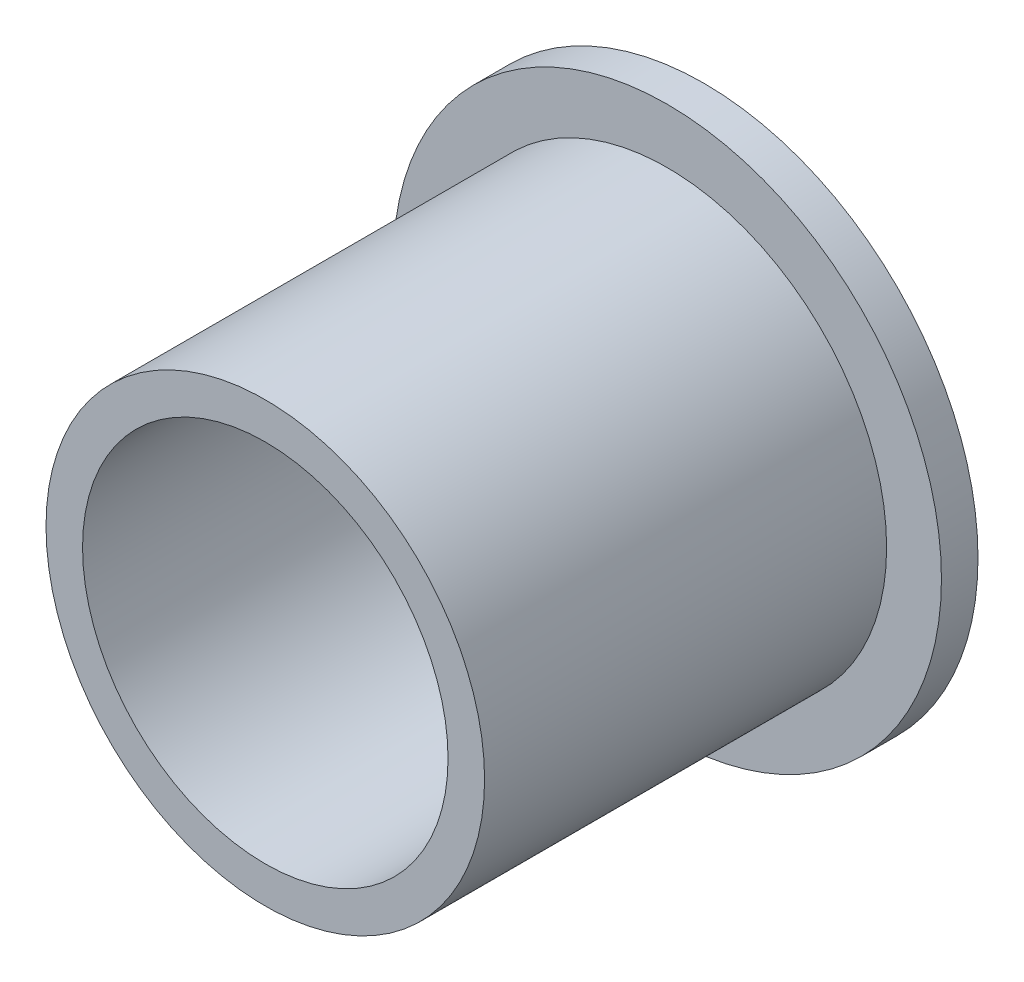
ISO-10303-21;
HEADER;
FILE_DESCRIPTION(('STEP AP214'),'2;1');
FILE_NAME('part.step','',(''),(''),'','','');
FILE_SCHEMA(('AUTOMOTIVE_DESIGN { 1 0 10303 214 1 1 1 1 }'));
ENDSEC;
DATA;
#1=APPLICATION_CONTEXT('core data for automotive mechanical design processes');
#2=APPLICATION_PROTOCOL_DEFINITION('international standard','automotive_design',2000,#1);
#3=PRODUCT_CONTEXT('',#1,'mechanical');
#4=PRODUCT('Part','Part','',(#3));
#5=PRODUCT_RELATED_PRODUCT_CATEGORY('part','',(#4));
#6=PRODUCT_DEFINITION_FORMATION('','',#4);
#7=PRODUCT_DEFINITION_CONTEXT('part definition',#1,'design');
#8=PRODUCT_DEFINITION('design','',#6,#7);
#9=PRODUCT_DEFINITION_SHAPE('','',#8);
#10=(LENGTH_UNIT() NAMED_UNIT(*) SI_UNIT(.MILLI.,.METRE.));
#11=(NAMED_UNIT(*) PLANE_ANGLE_UNIT() SI_UNIT($,.RADIAN.));
#12=(NAMED_UNIT(*) SI_UNIT($,.STERADIAN.) SOLID_ANGLE_UNIT());
#13=UNCERTAINTY_MEASURE_WITH_UNIT(LENGTH_MEASURE(1.E-05),#10,'distance_accuracy_value','');
#14=(GEOMETRIC_REPRESENTATION_CONTEXT(3) GLOBAL_UNCERTAINTY_ASSIGNED_CONTEXT((#13)) GLOBAL_UNIT_ASSIGNED_CONTEXT((#10,
#11,#12)) REPRESENTATION_CONTEXT('',''));
#15=CARTESIAN_POINT('',(0.,0.,0.));
#16=DIRECTION('',(0.,0.,1.));
#17=DIRECTION('',(1.,0.,0.));
#18=AXIS2_PLACEMENT_3D('',#15,#16,#17);
#19=CARTESIAN_POINT('',(0.,6.,0.));
#20=DIRECTION('',(0.,0.,-1.));
#21=DIRECTION('',(-1.,0.,0.));
#22=AXIS2_PLACEMENT_3D('',#19,#20,#21);
#23=PLANE('',#22);
#24=CARTESIAN_POINT('',(0.,0.,0.));
#25=DIRECTION('',(0.,0.,1.));
#26=DIRECTION('',(1.,0.,0.));
#27=AXIS2_PLACEMENT_3D('',#24,#25,#26);
#28=CIRCLE('',#27,5.);
#29=CARTESIAN_POINT('',(5.,0.,0.));
#30=VERTEX_POINT('',#29);
#31=EDGE_CURVE('E10',#30,#30,#28,.T.);
#32=ORIENTED_EDGE('',*,*,#31,.F.);
#33=EDGE_LOOP('',(#32));
#34=FACE_BOUND('',#33,.T.);
#35=CARTESIAN_POINT('',(0.,0.,0.));
#36=DIRECTION('',(0.,0.,1.));
#37=DIRECTION('',(1.,0.,0.));
#38=AXIS2_PLACEMENT_3D('',#35,#36,#37);
#39=CIRCLE('',#38,6.);
#40=CARTESIAN_POINT('',(6.,0.,0.));
#41=VERTEX_POINT('',#40);
#42=EDGE_CURVE('E53',#41,#41,#39,.T.);
#43=ORIENTED_EDGE('',*,*,#42,.T.);
#44=EDGE_LOOP('',(#43));
#45=FACE_BOUND('',#44,.T.);
#46=ADVANCED_FACE('F31',(#34,#45),#23,.F.);
#47=CARTESIAN_POINT('',(0.,0.,0.));
#48=DIRECTION('',(0.,0.,1.));
#49=DIRECTION('',(1.,0.,0.));
#50=AXIS2_PLACEMENT_3D('',#47,#48,#49);
#51=CYLINDRICAL_SURFACE('',#50,5.);
#52=CARTESIAN_POINT('',(0.,0.,-12.));
#53=DIRECTION('',(0.,0.,1.));
#54=DIRECTION('',(1.,0.,0.));
#55=AXIS2_PLACEMENT_3D('',#52,#53,#54);
#56=CIRCLE('',#55,5.);
#57=CARTESIAN_POINT('',(5.,0.,-12.));
#58=VERTEX_POINT('',#57);
#59=EDGE_CURVE('E37',#58,#58,#56,.T.);
#60=ORIENTED_EDGE('',*,*,#59,.F.);
#61=EDGE_LOOP('',(#60));
#62=FACE_BOUND('',#61,.T.);
#63=ORIENTED_EDGE('',*,*,#31,.T.);
#64=EDGE_LOOP('',(#63));
#65=FACE_BOUND('',#64,.T.);
#66=ADVANCED_FACE('F78',(#62,#65),#51,.F.);
#67=CARTESIAN_POINT('',(0.,5.,-12.));
#68=DIRECTION('',(0.,0.,1.));
#69=DIRECTION('',(1.,0.,0.));
#70=AXIS2_PLACEMENT_3D('',#67,#68,#69);
#71=PLANE('',#70);
#72=CARTESIAN_POINT('',(0.,0.,-12.));
#73=DIRECTION('',(0.,0.,1.));
#74=DIRECTION('',(1.,0.,0.));
#75=AXIS2_PLACEMENT_3D('',#72,#73,#74);
#76=CIRCLE('',#75,7.5);
#77=CARTESIAN_POINT('',(7.5,0.,-12.));
#78=VERTEX_POINT('',#77);
#79=EDGE_CURVE('E41',#78,#78,#76,.T.);
#80=ORIENTED_EDGE('',*,*,#79,.F.);
#81=EDGE_LOOP('',(#80));
#82=FACE_BOUND('',#81,.T.);
#83=ORIENTED_EDGE('',*,*,#59,.T.);
#84=EDGE_LOOP('',(#83));
#85=FACE_BOUND('',#84,.T.);
#86=ADVANCED_FACE('F73',(#82,#85),#71,.F.);
#87=CARTESIAN_POINT('',(0.,0.,0.));
#88=DIRECTION('',(0.,0.,1.));
#89=DIRECTION('',(1.,0.,0.));
#90=AXIS2_PLACEMENT_3D('',#87,#88,#89);
#91=CYLINDRICAL_SURFACE('',#90,7.5);
#92=CARTESIAN_POINT('',(0.,0.,-11.));
#93=DIRECTION('',(0.,0.,1.));
#94=DIRECTION('',(1.,0.,0.));
#95=AXIS2_PLACEMENT_3D('',#92,#93,#94);
#96=CIRCLE('',#95,7.5);
#97=CARTESIAN_POINT('',(7.5,0.,-11.));
#98=VERTEX_POINT('',#97);
#99=EDGE_CURVE('E45',#98,#98,#96,.T.);
#100=ORIENTED_EDGE('',*,*,#99,.F.);
#101=EDGE_LOOP('',(#100));
#102=FACE_BOUND('',#101,.T.);
#103=ORIENTED_EDGE('',*,*,#79,.T.);
#104=EDGE_LOOP('',(#103));
#105=FACE_BOUND('',#104,.T.);
#106=ADVANCED_FACE('F67',(#102,#105),#91,.T.);
#107=CARTESIAN_POINT('',(0.,7.5,-11.));
#108=DIRECTION('',(0.,0.,-1.));
#109=DIRECTION('',(-1.,0.,0.));
#110=AXIS2_PLACEMENT_3D('',#107,#108,#109);
#111=PLANE('',#110);
#112=CARTESIAN_POINT('',(0.,0.,-11.));
#113=DIRECTION('',(0.,0.,1.));
#114=DIRECTION('',(1.,0.,0.));
#115=AXIS2_PLACEMENT_3D('',#112,#113,#114);
#116=CIRCLE('',#115,6.);
#117=CARTESIAN_POINT('',(6.,0.,-11.));
#118=VERTEX_POINT('',#117);
#119=EDGE_CURVE('E50',#118,#118,#116,.T.);
#120=ORIENTED_EDGE('',*,*,#119,.F.);
#121=EDGE_LOOP('',(#120));
#122=FACE_BOUND('',#121,.T.);
#123=ORIENTED_EDGE('',*,*,#99,.T.);
#124=EDGE_LOOP('',(#123));
#125=FACE_BOUND('',#124,.T.);
#126=ADVANCED_FACE('F61',(#122,#125),#111,.F.);
#127=CARTESIAN_POINT('',(0.,0.,0.));
#128=DIRECTION('',(0.,0.,1.));
#129=DIRECTION('',(1.,0.,0.));
#130=AXIS2_PLACEMENT_3D('',#127,#128,#129);
#131=CYLINDRICAL_SURFACE('',#130,6.);
#132=ORIENTED_EDGE('',*,*,#42,.F.);
#133=EDGE_LOOP('',(#132));
#134=FACE_BOUND('',#133,.T.);
#135=ORIENTED_EDGE('',*,*,#119,.T.);
#136=EDGE_LOOP('',(#135));
#137=FACE_BOUND('',#136,.T.);
#138=ADVANCED_FACE('F58',(#134,#137),#131,.T.);
#139=CLOSED_SHELL('',(#46,#66,#86,#106,#126,#138));
#140=MANIFOLD_SOLID_BREP('B2',#139);
#141=ADVANCED_BREP_SHAPE_REPRESENTATION('',(#18,#140),#14);
#142=SHAPE_DEFINITION_REPRESENTATION(#9,#141);
ENDSEC;
END-ISO-10303-21;
